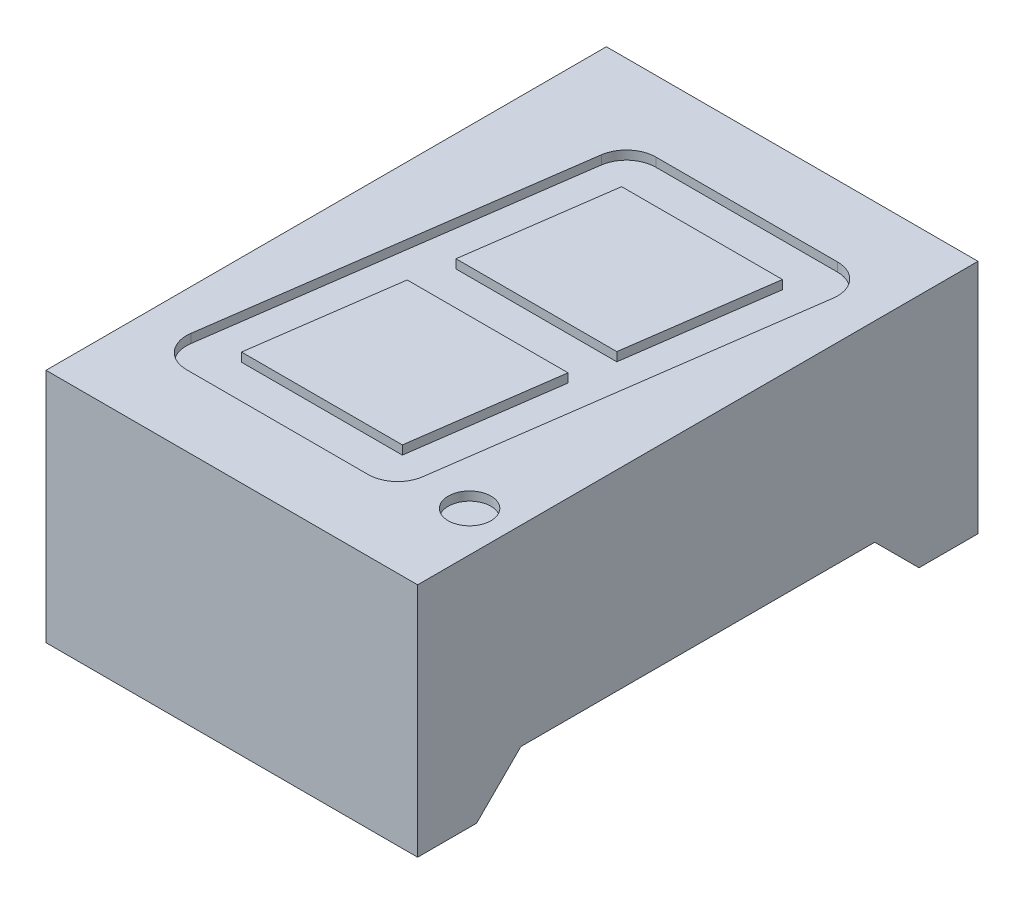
from build123d import *

# Parameters (mm, degrees)
SKETCH1_W           = 12.6
SKETCH1_H           = 19
BOSS_EXTRUDE1_DEPTH = 8
SKETCH2_R           = 0.725
CUT_EXTRUDE1_DEPTH  = 0.3
CUT_EXTRUDE2_DEPTH  = 25.161125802


with BuildPart() as part:
    # Sketch1 → Boss-Extrude1 (new body)
    with BuildSketch(Plane(origin=(0, 0, 0), x_dir=(1, 0, 0), z_dir=(0, 1, 0))):
        with Locations((6.3, -9.5)):
            Rectangle(SKETCH1_W, SKETCH1_H)
    extrude(amount=BOSS_EXTRUDE1_DEPTH)

    # Sketch2 → Cut-Extrude1 (cut)
    # profile 1 of 2: a face of its own
    with BuildSketch(Plane(origin=(0, 8, 0), x_dir=(1, 0, 0), z_dir=(0, 1, 0))):
        with Locations(Location((11.237273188, -15.875, 0), (0, 0, 270))):
            Circle(SKETCH2_R)
    # profile 2 of 2: a face of its own
    with BuildSketch(Plane(origin=(0, 8, 0), x_dir=(1, 0, 0), z_dir=(0, 1, 0))):
        with BuildLine():
            Line((1.372458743, -15.460826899), (3.087056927, -3.260826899))
            ThreePointArc((3.087056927, -3.260826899), (3.421265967, -2.64529042), (4.077324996, -2.4))
            Line((4.077324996, -2.4), (10.237273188, -2.4))
            ThreePointArc((10.237273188, -2.4), (10.991982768, -2.743940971), (11.227541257, -3.539173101))
            Line((11.227541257, -3.539173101), (9.512943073, -15.739173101))
            ThreePointArc((9.512943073, -15.739173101), (9.178734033, -16.35470958), (8.522675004, -16.6))
            Line((8.522675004, -16.6), (2.362726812, -16.6))
            ThreePointArc((2.362726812, -16.6), (1.608017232, -16.256059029), (1.372458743, -15.460826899))
        make_face()
        Polygon((3.675357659, -8.775), (4.36752127, -3.85), (9.820590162, -3.85), (9.128426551, -8.775), align=None, mode=Mode.SUBTRACT)
        Polygon((2.779409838, -15.15), (3.471573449, -10.225), (8.924642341, -10.225), (8.23247873, -15.15), align=None, mode=Mode.SUBTRACT)
    extrude(amount=-CUT_EXTRUDE1_DEPTH, mode=Mode.SUBTRACT)

    # Sketch3 → Cut-Extrude2 (cut, through all)
    with BuildSketch(Plane.ZY):
        Polygon((2, 0), (3.5, 1.5), (15.5, 1.5), (17, 0), align=None)
    extrude(amount=-CUT_EXTRUDE2_DEPTH, mode=Mode.SUBTRACT)


solid = part.part
